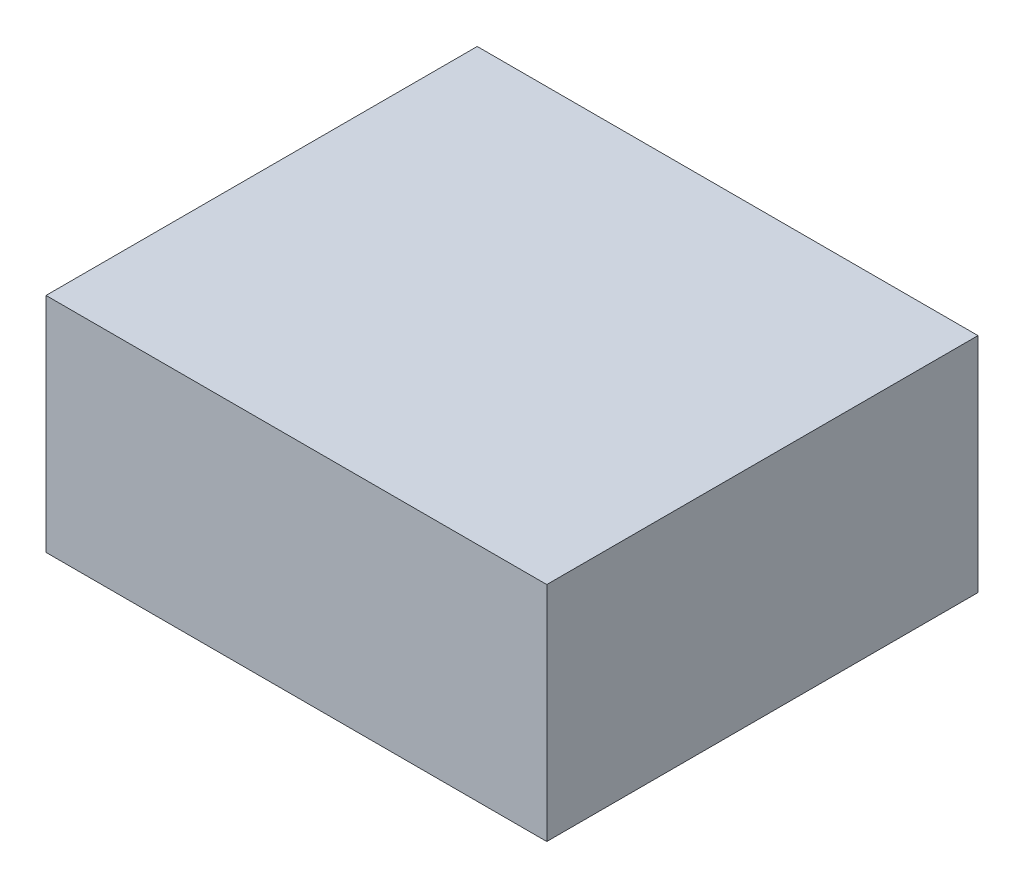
ISO-10303-21;
HEADER;
FILE_DESCRIPTION(('STEP AP214'),'2;1');
FILE_NAME('part.step','',(''),(''),'','','');
FILE_SCHEMA(('AUTOMOTIVE_DESIGN { 1 0 10303 214 1 1 1 1 }'));
ENDSEC;
DATA;
#1=APPLICATION_CONTEXT('core data for automotive mechanical design processes');
#2=APPLICATION_PROTOCOL_DEFINITION('international standard','automotive_design',2000,#1);
#3=PRODUCT_CONTEXT('',#1,'mechanical');
#4=PRODUCT('Part','Part','',(#3));
#5=PRODUCT_RELATED_PRODUCT_CATEGORY('part','',(#4));
#6=PRODUCT_DEFINITION_FORMATION('','',#4);
#7=PRODUCT_DEFINITION_CONTEXT('part definition',#1,'design');
#8=PRODUCT_DEFINITION('design','',#6,#7);
#9=PRODUCT_DEFINITION_SHAPE('','',#8);
#10=(LENGTH_UNIT() NAMED_UNIT(*) SI_UNIT(.MILLI.,.METRE.));
#11=(NAMED_UNIT(*) PLANE_ANGLE_UNIT() SI_UNIT($,.RADIAN.));
#12=(NAMED_UNIT(*) SI_UNIT($,.STERADIAN.) SOLID_ANGLE_UNIT());
#13=UNCERTAINTY_MEASURE_WITH_UNIT(LENGTH_MEASURE(1.E-05),#10,'distance_accuracy_value','');
#14=(GEOMETRIC_REPRESENTATION_CONTEXT(3) GLOBAL_UNCERTAINTY_ASSIGNED_CONTEXT((#13)) GLOBAL_UNIT_ASSIGNED_CONTEXT((#10,
#11,#12)) REPRESENTATION_CONTEXT('',''));
#15=CARTESIAN_POINT('',(0.,0.,0.));
#16=DIRECTION('',(0.,0.,1.));
#17=DIRECTION('',(1.,0.,0.));
#18=AXIS2_PLACEMENT_3D('',#15,#16,#17);
#19=CARTESIAN_POINT('',(9.,8.,-7.75));
#20=DIRECTION('',(-1.,0.,0.));
#21=DIRECTION('',(0.,0.,1.));
#22=AXIS2_PLACEMENT_3D('',#19,#20,#21);
#23=PLANE('',#22);
#24=DIRECTION('',(0.,0.,-1.));
#25=VECTOR('',#24,1.);
#26=CARTESIAN_POINT('',(9.,0.,-7.75));
#27=LINE('',#26,#25);
#28=CARTESIAN_POINT('',(9.,0.,7.75));
#29=VERTEX_POINT('',#28);
#30=CARTESIAN_POINT('',(9.,0.,-7.75));
#31=VERTEX_POINT('',#30);
#32=EDGE_CURVE('E100',#29,#31,#27,.T.);
#33=ORIENTED_EDGE('',*,*,#32,.T.);
#34=DIRECTION('',(0.,-1.,0.));
#35=VECTOR('',#34,1.);
#36=CARTESIAN_POINT('',(9.,8.,-7.75));
#37=LINE('',#36,#35);
#38=CARTESIAN_POINT('',(9.,8.,-7.75));
#39=VERTEX_POINT('',#38);
#40=EDGE_CURVE('E11',#39,#31,#37,.T.);
#41=ORIENTED_EDGE('',*,*,#40,.F.);
#42=DIRECTION('',(0.,0.,-1.));
#43=VECTOR('',#42,1.);
#44=CARTESIAN_POINT('',(9.,8.,-7.75));
#45=LINE('',#44,#43);
#46=CARTESIAN_POINT('',(9.,8.,7.75));
#47=VERTEX_POINT('',#46);
#48=EDGE_CURVE('E88',#47,#39,#45,.T.);
#49=ORIENTED_EDGE('',*,*,#48,.F.);
#50=DIRECTION('',(0.,-1.,0.));
#51=VECTOR('',#50,1.);
#52=CARTESIAN_POINT('',(9.,8.,7.75));
#53=LINE('',#52,#51);
#54=EDGE_CURVE('E96',#47,#29,#53,.T.);
#55=ORIENTED_EDGE('',*,*,#54,.T.);
#56=EDGE_LOOP('',(#33,#41,#49,#55));
#57=FACE_BOUND('',#56,.T.);
#58=ADVANCED_FACE('F37',(#57),#23,.F.);
#59=CARTESIAN_POINT('',(-9.,8.,-7.75));
#60=DIRECTION('',(0.,0.,1.));
#61=DIRECTION('',(1.,0.,0.));
#62=AXIS2_PLACEMENT_3D('',#59,#60,#61);
#63=PLANE('',#62);
#64=DIRECTION('',(-1.,0.,0.));
#65=VECTOR('',#64,1.);
#66=CARTESIAN_POINT('',(-9.,0.,-7.75));
#67=LINE('',#66,#65);
#68=CARTESIAN_POINT('',(-9.,0.,-7.75));
#69=VERTEX_POINT('',#68);
#70=EDGE_CURVE('E92',#31,#69,#67,.T.);
#71=ORIENTED_EDGE('',*,*,#70,.T.);
#72=DIRECTION('',(0.,-1.,0.));
#73=VECTOR('',#72,1.);
#74=CARTESIAN_POINT('',(-9.,8.,-7.75));
#75=LINE('',#74,#73);
#76=CARTESIAN_POINT('',(-9.,8.,-7.75));
#77=VERTEX_POINT('',#76);
#78=EDGE_CURVE('E45',#77,#69,#75,.T.);
#79=ORIENTED_EDGE('',*,*,#78,.F.);
#80=DIRECTION('',(-1.,0.,0.));
#81=VECTOR('',#80,1.);
#82=CARTESIAN_POINT('',(-9.,8.,-7.75));
#83=LINE('',#82,#81);
#84=EDGE_CURVE('E83',#39,#77,#83,.T.);
#85=ORIENTED_EDGE('',*,*,#84,.F.);
#86=ORIENTED_EDGE('',*,*,#40,.T.);
#87=EDGE_LOOP('',(#71,#79,#85,#86));
#88=FACE_BOUND('',#87,.T.);
#89=ADVANCED_FACE('F91',(#88),#63,.F.);
#90=CARTESIAN_POINT('',(-9.,8.,-7.75));
#91=DIRECTION('',(1.,0.,0.));
#92=DIRECTION('',(0.,0.,-1.));
#93=AXIS2_PLACEMENT_3D('',#90,#91,#92);
#94=PLANE('',#93);
#95=DIRECTION('',(0.,0.,1.));
#96=VECTOR('',#95,1.);
#97=CARTESIAN_POINT('',(-9.,0.,-7.75));
#98=LINE('',#97,#96);
#99=CARTESIAN_POINT('',(-9.,0.,7.75));
#100=VERTEX_POINT('',#99);
#101=EDGE_CURVE('E70',#69,#100,#98,.T.);
#102=ORIENTED_EDGE('',*,*,#101,.T.);
#103=DIRECTION('',(0.,-1.,0.));
#104=VECTOR('',#103,1.);
#105=CARTESIAN_POINT('',(-9.,8.,7.75));
#106=LINE('',#105,#104);
#107=CARTESIAN_POINT('',(-9.,8.,7.75));
#108=VERTEX_POINT('',#107);
#109=EDGE_CURVE('E93',#108,#100,#106,.T.);
#110=ORIENTED_EDGE('',*,*,#109,.F.);
#111=DIRECTION('',(0.,0.,1.));
#112=VECTOR('',#111,1.);
#113=CARTESIAN_POINT('',(-9.,8.,-7.75));
#114=LINE('',#113,#112);
#115=EDGE_CURVE('E86',#77,#108,#114,.T.);
#116=ORIENTED_EDGE('',*,*,#115,.F.);
#117=ORIENTED_EDGE('',*,*,#78,.T.);
#118=EDGE_LOOP('',(#102,#110,#116,#117));
#119=FACE_BOUND('',#118,.T.);
#120=ADVANCED_FACE('F94',(#119),#94,.F.);
#121=CARTESIAN_POINT('',(-9.,8.,7.75));
#122=DIRECTION('',(0.,0.,-1.));
#123=DIRECTION('',(-1.,0.,0.));
#124=AXIS2_PLACEMENT_3D('',#121,#122,#123);
#125=PLANE('',#124);
#126=DIRECTION('',(1.,0.,0.));
#127=VECTOR('',#126,1.);
#128=CARTESIAN_POINT('',(-9.,0.,7.75));
#129=LINE('',#128,#127);
#130=EDGE_CURVE('E76',#100,#29,#129,.T.);
#131=ORIENTED_EDGE('',*,*,#130,.T.);
#132=ORIENTED_EDGE('',*,*,#54,.F.);
#133=DIRECTION('',(1.,0.,0.));
#134=VECTOR('',#133,1.);
#135=CARTESIAN_POINT('',(-9.,8.,7.75));
#136=LINE('',#135,#134);
#137=EDGE_CURVE('E53',#108,#47,#136,.T.);
#138=ORIENTED_EDGE('',*,*,#137,.F.);
#139=ORIENTED_EDGE('',*,*,#109,.T.);
#140=EDGE_LOOP('',(#131,#132,#138,#139));
#141=FACE_BOUND('',#140,.T.);
#142=ADVANCED_FACE('F107',(#141),#125,.F.);
#143=CARTESIAN_POINT('',(0.,8.,0.));
#144=DIRECTION('',(0.,1.,0.));
#145=DIRECTION('',(0.,0.,1.));
#146=AXIS2_PLACEMENT_3D('',#143,#144,#145);
#147=PLANE('',#146);
#148=ORIENTED_EDGE('',*,*,#48,.T.);
#149=ORIENTED_EDGE('',*,*,#84,.T.);
#150=ORIENTED_EDGE('',*,*,#115,.T.);
#151=ORIENTED_EDGE('',*,*,#137,.T.);
#152=EDGE_LOOP('',(#148,#149,#150,#151));
#153=FACE_BOUND('',#152,.T.);
#154=ADVANCED_FACE('F84',(#153),#147,.T.);
#155=CARTESIAN_POINT('',(0.,0.,0.));
#156=DIRECTION('',(0.,1.,0.));
#157=DIRECTION('',(0.,0.,1.));
#158=AXIS2_PLACEMENT_3D('',#155,#156,#157);
#159=PLANE('',#158);
#160=ORIENTED_EDGE('',*,*,#32,.F.);
#161=ORIENTED_EDGE('',*,*,#130,.F.);
#162=ORIENTED_EDGE('',*,*,#101,.F.);
#163=ORIENTED_EDGE('',*,*,#70,.F.);
#164=EDGE_LOOP('',(#160,#161,#162,#163));
#165=FACE_BOUND('',#164,.T.);
#166=ADVANCED_FACE('F110',(#165),#159,.F.);
#167=CLOSED_SHELL('',(#58,#89,#120,#142,#154,#166));
#168=MANIFOLD_SOLID_BREP('B2',#167);
#169=ADVANCED_BREP_SHAPE_REPRESENTATION('',(#18,#168),#14);
#170=SHAPE_DEFINITION_REPRESENTATION(#9,#169);
ENDSEC;
END-ISO-10303-21;
